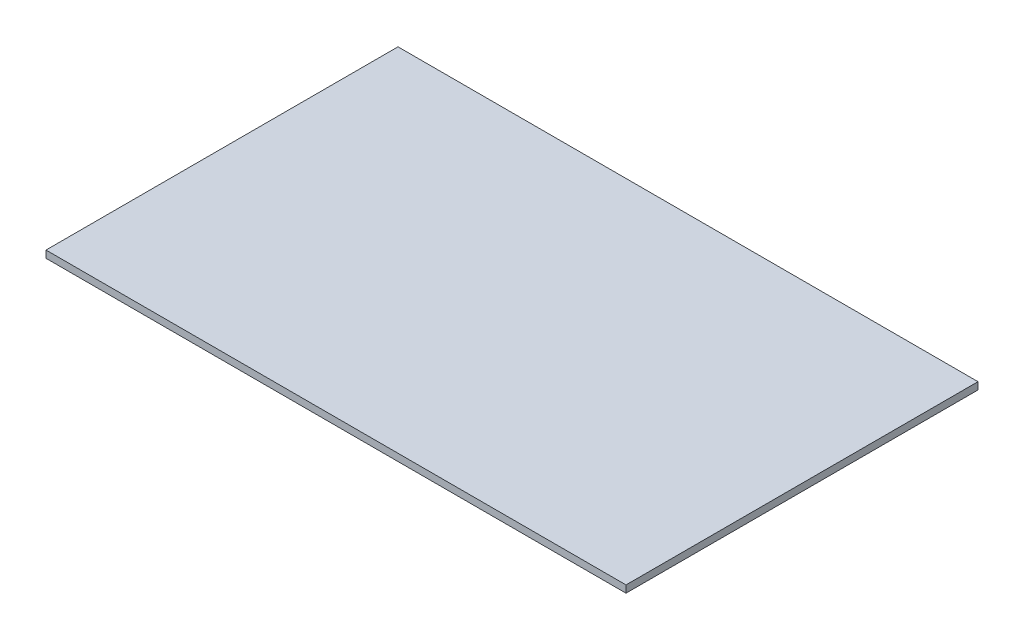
from build123d import *

# Parameters (mm, degrees)
SKETCH1_W      = 1025.398
SKETCH1_H      = 622.3
EXTRUDE1_DEPTH = 12.7


with BuildPart() as part:
    # Sketch1 → Extrude1 (new body)
    with BuildSketch(Plane(origin=(0, 0, 0), x_dir=(1, 0, 0), z_dir=(0, 1, 0))):
        with Locations((512.699, 311.15)):
            Rectangle(SKETCH1_W, SKETCH1_H)
    extrude(amount=EXTRUDE1_DEPTH)


solid = part.part
